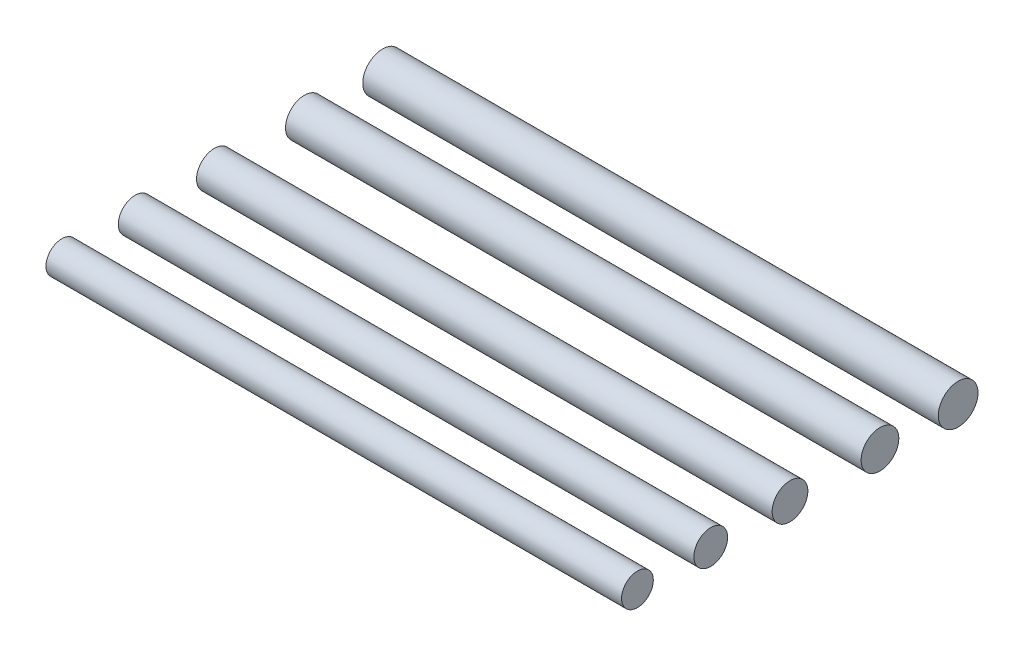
ISO-10303-21;
HEADER;
FILE_DESCRIPTION(('STEP AP214'),'2;1');
FILE_NAME('part.step','',(''),(''),'','','');
FILE_SCHEMA(('AUTOMOTIVE_DESIGN { 1 0 10303 214 1 1 1 1 }'));
ENDSEC;
DATA;
#1=APPLICATION_CONTEXT('core data for automotive mechanical design processes');
#2=APPLICATION_PROTOCOL_DEFINITION('international standard','automotive_design',2000,#1);
#3=PRODUCT_CONTEXT('',#1,'mechanical');
#4=PRODUCT('Part','Part','',(#3));
#5=PRODUCT_RELATED_PRODUCT_CATEGORY('part','',(#4));
#6=PRODUCT_DEFINITION_FORMATION('','',#4);
#7=PRODUCT_DEFINITION_CONTEXT('part definition',#1,'design');
#8=PRODUCT_DEFINITION('design','',#6,#7);
#9=PRODUCT_DEFINITION_SHAPE('','',#8);
#10=(LENGTH_UNIT() NAMED_UNIT(*) SI_UNIT(.MILLI.,.METRE.));
#11=(NAMED_UNIT(*) PLANE_ANGLE_UNIT() SI_UNIT($,.RADIAN.));
#12=(NAMED_UNIT(*) SI_UNIT($,.STERADIAN.) SOLID_ANGLE_UNIT());
#13=UNCERTAINTY_MEASURE_WITH_UNIT(LENGTH_MEASURE(1.E-05),#10,'distance_accuracy_value','');
#14=(GEOMETRIC_REPRESENTATION_CONTEXT(3) GLOBAL_UNCERTAINTY_ASSIGNED_CONTEXT((#13)) GLOBAL_UNIT_ASSIGNED_CONTEXT((#10,
#11,#12)) REPRESENTATION_CONTEXT('',''));
#15=CARTESIAN_POINT('',(0.,0.,0.));
#16=DIRECTION('',(0.,0.,1.));
#17=DIRECTION('',(1.,0.,0.));
#18=AXIS2_PLACEMENT_3D('',#15,#16,#17);
#19=CARTESIAN_POINT('',(-87.,0.,48.4770129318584));
#20=DIRECTION('',(1.,0.,0.));
#21=DIRECTION('',(0.,0.,-1.));
#22=AXIS2_PLACEMENT_3D('',#19,#20,#21);
#23=CYLINDRICAL_SURFACE('',#22,2.4);
#24=CARTESIAN_POINT('',(-87.,0.,48.4770129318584));
#25=DIRECTION('',(1.,0.,0.));
#26=DIRECTION('',(0.,0.,-1.));
#27=AXIS2_PLACEMENT_3D('',#24,#25,#26);
#28=CIRCLE('',#27,2.4);
#29=CARTESIAN_POINT('',(-87.,0.,46.0770129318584));
#30=VERTEX_POINT('',#29);
#31=EDGE_CURVE('E11',#30,#30,#28,.T.);
#32=ORIENTED_EDGE('',*,*,#31,.T.);
#33=EDGE_LOOP('',(#32));
#34=FACE_BOUND('',#33,.T.);
#35=CARTESIAN_POINT('',(0.,0.,48.4770129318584));
#36=DIRECTION('',(1.,0.,0.));
#37=DIRECTION('',(0.,0.,-1.));
#38=AXIS2_PLACEMENT_3D('',#35,#36,#37);
#39=CIRCLE('',#38,2.4);
#40=CARTESIAN_POINT('',(0.,0.,46.0770129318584));
#41=VERTEX_POINT('',#40);
#42=EDGE_CURVE('E43',#41,#41,#39,.T.);
#43=ORIENTED_EDGE('',*,*,#42,.F.);
#44=EDGE_LOOP('',(#43));
#45=FACE_BOUND('',#44,.T.);
#46=ADVANCED_FACE('F40',(#34,#45),#23,.T.);
#47=CARTESIAN_POINT('',(-87.,0.,48.4770129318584));
#48=DIRECTION('',(1.,0.,0.));
#49=DIRECTION('',(0.,0.,-1.));
#50=AXIS2_PLACEMENT_3D('',#47,#48,#49);
#51=PLANE('',#50);
#52=ORIENTED_EDGE('',*,*,#31,.F.);
#53=EDGE_LOOP('',(#52));
#54=FACE_BOUND('',#53,.T.);
#55=ADVANCED_FACE('F55',(#54),#51,.F.);
#56=CARTESIAN_POINT('',(0.,0.,48.4770129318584));
#57=DIRECTION('',(1.,0.,0.));
#58=DIRECTION('',(0.,0.,-1.));
#59=AXIS2_PLACEMENT_3D('',#56,#57,#58);
#60=PLANE('',#59);
#61=ORIENTED_EDGE('',*,*,#42,.T.);
#62=EDGE_LOOP('',(#61));
#63=FACE_BOUND('',#62,.T.);
#64=ADVANCED_FACE('F52',(#63),#60,.T.);
#65=CLOSED_SHELL('',(#46,#55,#64));
#66=MANIFOLD_SOLID_BREP('B2',#65);
#67=CARTESIAN_POINT('',(-87.,0.,37.3969701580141));
#68=DIRECTION('',(1.,0.,0.));
#69=DIRECTION('',(0.,0.,-1.));
#70=AXIS2_PLACEMENT_3D('',#67,#68,#69);
#71=CYLINDRICAL_SURFACE('',#70,2.55);
#72=CARTESIAN_POINT('',(-87.,0.,37.3969701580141));
#73=DIRECTION('',(1.,0.,0.));
#74=DIRECTION('',(0.,0.,-1.));
#75=AXIS2_PLACEMENT_3D('',#72,#73,#74);
#76=CIRCLE('',#75,2.55);
#77=CARTESIAN_POINT('',(-87.,0.,34.8469701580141));
#78=VERTEX_POINT('',#77);
#79=EDGE_CURVE('E39',#78,#78,#76,.T.);
#80=ORIENTED_EDGE('',*,*,#79,.T.);
#81=EDGE_LOOP('',(#80));
#82=FACE_BOUND('',#81,.T.);
#83=CARTESIAN_POINT('',(0.,0.,37.3969701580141));
#84=DIRECTION('',(1.,0.,0.));
#85=DIRECTION('',(0.,0.,-1.));
#86=AXIS2_PLACEMENT_3D('',#83,#84,#85);
#87=CIRCLE('',#86,2.55);
#88=CARTESIAN_POINT('',(0.,0.,34.8469701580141));
#89=VERTEX_POINT('',#88);
#90=EDGE_CURVE('E92',#89,#89,#87,.T.);
#91=ORIENTED_EDGE('',*,*,#90,.F.);
#92=EDGE_LOOP('',(#91));
#93=FACE_BOUND('',#92,.T.);
#94=ADVANCED_FACE('F89',(#82,#93),#71,.T.);
#95=CARTESIAN_POINT('',(-87.,0.,37.3969701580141));
#96=DIRECTION('',(1.,0.,0.));
#97=DIRECTION('',(0.,0.,-1.));
#98=AXIS2_PLACEMENT_3D('',#95,#96,#97);
#99=PLANE('',#98);
#100=ORIENTED_EDGE('',*,*,#79,.F.);
#101=EDGE_LOOP('',(#100));
#102=FACE_BOUND('',#101,.T.);
#103=ADVANCED_FACE('F104',(#102),#99,.F.);
#104=CARTESIAN_POINT('',(0.,0.,37.3969701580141));
#105=DIRECTION('',(1.,0.,0.));
#106=DIRECTION('',(0.,0.,-1.));
#107=AXIS2_PLACEMENT_3D('',#104,#105,#106);
#108=PLANE('',#107);
#109=ORIENTED_EDGE('',*,*,#90,.T.);
#110=EDGE_LOOP('',(#109));
#111=FACE_BOUND('',#110,.T.);
#112=ADVANCED_FACE('F101',(#111),#108,.T.);
#113=CLOSED_SHELL('',(#94,#103,#112));
#114=MANIFOLD_SOLID_BREP('B6',#113);
#115=CARTESIAN_POINT('',(-87.,0.,25.4183503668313));
#116=DIRECTION('',(1.,0.,0.));
#117=DIRECTION('',(0.,0.,-1.));
#118=AXIS2_PLACEMENT_3D('',#115,#116,#117);
#119=CYLINDRICAL_SURFACE('',#118,2.7);
#120=CARTESIAN_POINT('',(-87.,0.,25.4183503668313));
#121=DIRECTION('',(1.,0.,0.));
#122=DIRECTION('',(0.,0.,-1.));
#123=AXIS2_PLACEMENT_3D('',#120,#121,#122);
#124=CIRCLE('',#123,2.7);
#125=CARTESIAN_POINT('',(-87.,0.,22.7183503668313));
#126=VERTEX_POINT('',#125);
#127=EDGE_CURVE('E88',#126,#126,#124,.T.);
#128=ORIENTED_EDGE('',*,*,#127,.T.);
#129=EDGE_LOOP('',(#128));
#130=FACE_BOUND('',#129,.T.);
#131=CARTESIAN_POINT('',(0.,0.,25.4183503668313));
#132=DIRECTION('',(1.,0.,0.));
#133=DIRECTION('',(0.,0.,-1.));
#134=AXIS2_PLACEMENT_3D('',#131,#132,#133);
#135=CIRCLE('',#134,2.7);
#136=CARTESIAN_POINT('',(0.,0.,22.7183503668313));
#137=VERTEX_POINT('',#136);
#138=EDGE_CURVE('E141',#137,#137,#135,.T.);
#139=ORIENTED_EDGE('',*,*,#138,.F.);
#140=EDGE_LOOP('',(#139));
#141=FACE_BOUND('',#140,.T.);
#142=ADVANCED_FACE('F138',(#130,#141),#119,.T.);
#143=CARTESIAN_POINT('',(-87.,0.,25.4183503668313));
#144=DIRECTION('',(1.,0.,0.));
#145=DIRECTION('',(0.,0.,-1.));
#146=AXIS2_PLACEMENT_3D('',#143,#144,#145);
#147=PLANE('',#146);
#148=ORIENTED_EDGE('',*,*,#127,.F.);
#149=EDGE_LOOP('',(#148));
#150=FACE_BOUND('',#149,.T.);
#151=ADVANCED_FACE('F153',(#150),#147,.F.);
#152=CARTESIAN_POINT('',(0.,0.,25.4183503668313));
#153=DIRECTION('',(1.,0.,0.));
#154=DIRECTION('',(0.,0.,-1.));
#155=AXIS2_PLACEMENT_3D('',#152,#153,#154);
#156=PLANE('',#155);
#157=ORIENTED_EDGE('',*,*,#138,.T.);
#158=EDGE_LOOP('',(#157));
#159=FACE_BOUND('',#158,.T.);
#160=ADVANCED_FACE('F150',(#159),#156,.T.);
#161=CLOSED_SHELL('',(#142,#151,#160));
#162=MANIFOLD_SOLID_BREP('B34',#161);
#163=CARTESIAN_POINT('',(-87.,0.,11.8183262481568));
#164=DIRECTION('',(1.,0.,0.));
#165=DIRECTION('',(0.,0.,-1.));
#166=AXIS2_PLACEMENT_3D('',#163,#164,#165);
#167=CYLINDRICAL_SURFACE('',#166,2.85);
#168=CARTESIAN_POINT('',(-87.,0.,11.8183262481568));
#169=DIRECTION('',(1.,0.,0.));
#170=DIRECTION('',(0.,0.,-1.));
#171=AXIS2_PLACEMENT_3D('',#168,#169,#170);
#172=CIRCLE('',#171,2.85);
#173=CARTESIAN_POINT('',(-87.,0.,8.96832624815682));
#174=VERTEX_POINT('',#173);
#175=EDGE_CURVE('E137',#174,#174,#172,.T.);
#176=ORIENTED_EDGE('',*,*,#175,.T.);
#177=EDGE_LOOP('',(#176));
#178=FACE_BOUND('',#177,.T.);
#179=CARTESIAN_POINT('',(0.,0.,11.8183262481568));
#180=DIRECTION('',(1.,0.,0.));
#181=DIRECTION('',(0.,0.,-1.));
#182=AXIS2_PLACEMENT_3D('',#179,#180,#181);
#183=CIRCLE('',#182,2.85);
#184=CARTESIAN_POINT('',(0.,0.,8.96832624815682));
#185=VERTEX_POINT('',#184);
#186=EDGE_CURVE('E189',#185,#185,#183,.T.);
#187=ORIENTED_EDGE('',*,*,#186,.F.);
#188=EDGE_LOOP('',(#187));
#189=FACE_BOUND('',#188,.T.);
#190=ADVANCED_FACE('F186',(#178,#189),#167,.T.);
#191=CARTESIAN_POINT('',(-87.,0.,11.8183262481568));
#192=DIRECTION('',(1.,0.,0.));
#193=DIRECTION('',(0.,0.,-1.));
#194=AXIS2_PLACEMENT_3D('',#191,#192,#193);
#195=PLANE('',#194);
#196=ORIENTED_EDGE('',*,*,#175,.F.);
#197=EDGE_LOOP('',(#196));
#198=FACE_BOUND('',#197,.T.);
#199=ADVANCED_FACE('F201',(#198),#195,.F.);
#200=CARTESIAN_POINT('',(0.,0.,11.8183262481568));
#201=DIRECTION('',(1.,0.,0.));
#202=DIRECTION('',(0.,0.,-1.));
#203=AXIS2_PLACEMENT_3D('',#200,#201,#202);
#204=PLANE('',#203);
#205=ORIENTED_EDGE('',*,*,#186,.T.);
#206=EDGE_LOOP('',(#205));
#207=FACE_BOUND('',#206,.T.);
#208=ADVANCED_FACE('F198',(#207),#204,.T.);
#209=CLOSED_SHELL('',(#190,#199,#208));
#210=MANIFOLD_SOLID_BREP('B83',#209);
#211=CARTESIAN_POINT('',(-87.,0.,0.));
#212=DIRECTION('',(1.,0.,0.));
#213=DIRECTION('',(0.,0.,-1.));
#214=AXIS2_PLACEMENT_3D('',#211,#212,#213);
#215=CYLINDRICAL_SURFACE('',#214,3.);
#216=CARTESIAN_POINT('',(-87.,0.,0.));
#217=DIRECTION('',(1.,0.,0.));
#218=DIRECTION('',(0.,0.,-1.));
#219=AXIS2_PLACEMENT_3D('',#216,#217,#218);
#220=CIRCLE('',#219,3.);
#221=CARTESIAN_POINT('',(-87.,0.,-3.));
#222=VERTEX_POINT('',#221);
#223=EDGE_CURVE('E185',#222,#222,#220,.T.);
#224=ORIENTED_EDGE('',*,*,#223,.T.);
#225=EDGE_LOOP('',(#224));
#226=FACE_BOUND('',#225,.T.);
#227=CARTESIAN_POINT('',(0.,0.,0.));
#228=DIRECTION('',(1.,0.,0.));
#229=DIRECTION('',(0.,0.,-1.));
#230=AXIS2_PLACEMENT_3D('',#227,#228,#229);
#231=CIRCLE('',#230,3.);
#232=CARTESIAN_POINT('',(0.,0.,-3.));
#233=VERTEX_POINT('',#232);
#234=EDGE_CURVE('E230',#233,#233,#231,.T.);
#235=ORIENTED_EDGE('',*,*,#234,.F.);
#236=EDGE_LOOP('',(#235));
#237=FACE_BOUND('',#236,.T.);
#238=ADVANCED_FACE('F227',(#226,#237),#215,.T.);
#239=CARTESIAN_POINT('',(-87.,0.,0.));
#240=DIRECTION('',(1.,0.,0.));
#241=DIRECTION('',(0.,0.,-1.));
#242=AXIS2_PLACEMENT_3D('',#239,#240,#241);
#243=PLANE('',#242);
#244=ORIENTED_EDGE('',*,*,#223,.F.);
#245=EDGE_LOOP('',(#244));
#246=FACE_BOUND('',#245,.T.);
#247=ADVANCED_FACE('F242',(#246),#243,.F.);
#248=CARTESIAN_POINT('',(0.,0.,0.));
#249=DIRECTION('',(1.,0.,0.));
#250=DIRECTION('',(0.,0.,-1.));
#251=AXIS2_PLACEMENT_3D('',#248,#249,#250);
#252=PLANE('',#251);
#253=ORIENTED_EDGE('',*,*,#234,.T.);
#254=EDGE_LOOP('',(#253));
#255=FACE_BOUND('',#254,.T.);
#256=ADVANCED_FACE('F239',(#255),#252,.T.);
#257=CLOSED_SHELL('',(#238,#247,#256));
#258=MANIFOLD_SOLID_BREP('B132',#257);
#259=ADVANCED_BREP_SHAPE_REPRESENTATION('',(#18,#66,#114,#162,#210,#258),#14);
#260=SHAPE_DEFINITION_REPRESENTATION(#9,#259);
ENDSEC;
END-ISO-10303-21;
